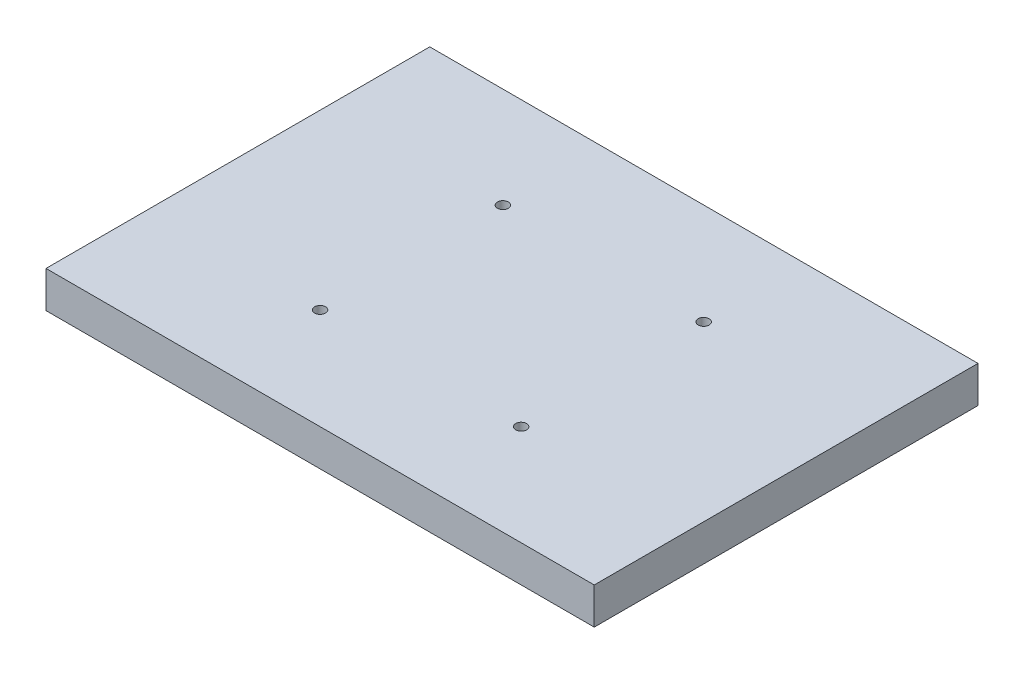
from build123d import *

# Parameters (mm, degrees)
SKETCH1_W           = 300
SKETCH1_H           = 210
SKETCH1_R           = 3
BOSS_EXTRUDE1_DEPTH = 20


with BuildPart() as part:
    # Sketch1 → Boss-Extrude1 (new body)
    with BuildSketch(Plane(origin=(0, 0, 0), x_dir=(1, 0, 0), z_dir=(0, 1, 0))):
        Rectangle(SKETCH1_W, SKETCH1_H)
        with Locations(Location((-55.351004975, -49.685154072, 0), (0, 0, 270))):
            Circle(SKETCH1_R, mode=Mode.SUBTRACT)
        with Locations(Location((55, -50, 0), (0, 0, 270))):
            Circle(SKETCH1_R, mode=Mode.SUBTRACT)
        with Locations(Location((-55, 50, 0), (0, 0, 270))):
            Circle(SKETCH1_R, mode=Mode.SUBTRACT)
        with Locations(Location((55.276685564, 49.61844216, 0), (0, 0, 270))):
            Circle(SKETCH1_R, mode=Mode.SUBTRACT)
    extrude(amount=-BOSS_EXTRUDE1_DEPTH)


solid = part.part
